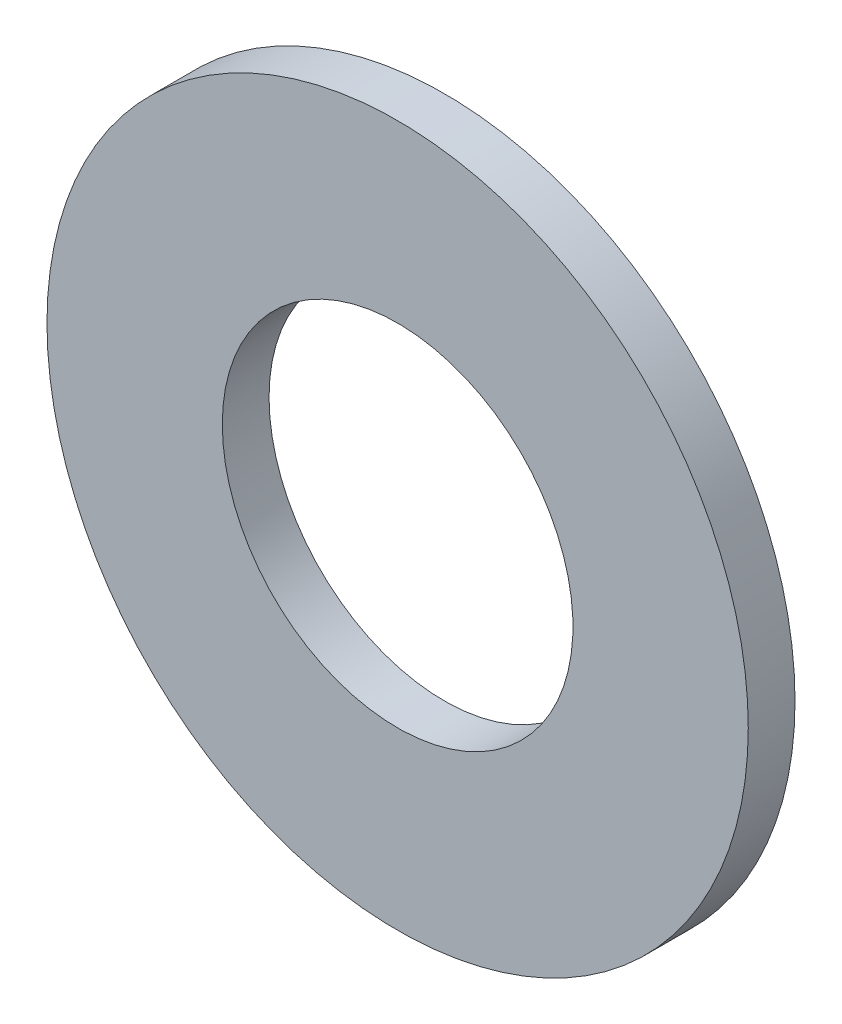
ISO-10303-21;
HEADER;
FILE_DESCRIPTION(('STEP AP214'),'2;1');
FILE_NAME('part.step','',(''),(''),'','','');
FILE_SCHEMA(('AUTOMOTIVE_DESIGN { 1 0 10303 214 1 1 1 1 }'));
ENDSEC;
DATA;
#1=APPLICATION_CONTEXT('core data for automotive mechanical design processes');
#2=APPLICATION_PROTOCOL_DEFINITION('international standard','automotive_design',2000,#1);
#3=PRODUCT_CONTEXT('',#1,'mechanical');
#4=PRODUCT('Part','Part','',(#3));
#5=PRODUCT_RELATED_PRODUCT_CATEGORY('part','',(#4));
#6=PRODUCT_DEFINITION_FORMATION('','',#4);
#7=PRODUCT_DEFINITION_CONTEXT('part definition',#1,'design');
#8=PRODUCT_DEFINITION('design','',#6,#7);
#9=PRODUCT_DEFINITION_SHAPE('','',#8);
#10=(LENGTH_UNIT() NAMED_UNIT(*) SI_UNIT(.MILLI.,.METRE.));
#11=(NAMED_UNIT(*) PLANE_ANGLE_UNIT() SI_UNIT($,.RADIAN.));
#12=(NAMED_UNIT(*) SI_UNIT($,.STERADIAN.) SOLID_ANGLE_UNIT());
#13=UNCERTAINTY_MEASURE_WITH_UNIT(LENGTH_MEASURE(1.E-05),#10,'distance_accuracy_value','');
#14=(GEOMETRIC_REPRESENTATION_CONTEXT(3) GLOBAL_UNCERTAINTY_ASSIGNED_CONTEXT((#13)) GLOBAL_UNIT_ASSIGNED_CONTEXT((#10,
#11,#12)) REPRESENTATION_CONTEXT('',''));
#15=CARTESIAN_POINT('',(0.,0.,0.));
#16=DIRECTION('',(0.,0.,1.));
#17=DIRECTION('',(1.,0.,0.));
#18=AXIS2_PLACEMENT_3D('',#15,#16,#17);
#19=CARTESIAN_POINT('',(0.,0.,0.2));
#20=DIRECTION('',(0.,0.,-1.));
#21=DIRECTION('',(-1.,0.,0.));
#22=AXIS2_PLACEMENT_3D('',#19,#20,#21);
#23=CYLINDRICAL_SURFACE('',#22,1.5);
#24=CARTESIAN_POINT('',(0.,0.,0.2));
#25=DIRECTION('',(0.,0.,-1.));
#26=DIRECTION('',(-1.,0.,0.));
#27=AXIS2_PLACEMENT_3D('',#24,#25,#26);
#28=CIRCLE('',#27,1.5);
#29=CARTESIAN_POINT('',(-1.5,0.,0.2));
#30=VERTEX_POINT('',#29);
#31=EDGE_CURVE('E19',#30,#30,#28,.F.);
#32=ORIENTED_EDGE('',*,*,#31,.F.);
#33=EDGE_LOOP('',(#32));
#34=FACE_BOUND('',#33,.T.);
#35=CARTESIAN_POINT('',(0.,0.,0.));
#36=DIRECTION('',(0.,0.,-1.));
#37=DIRECTION('',(-1.,0.,0.));
#38=AXIS2_PLACEMENT_3D('',#35,#36,#37);
#39=CIRCLE('',#38,1.5);
#40=CARTESIAN_POINT('',(-1.5,0.,0.));
#41=VERTEX_POINT('',#40);
#42=EDGE_CURVE('E28',#41,#41,#39,.F.);
#43=ORIENTED_EDGE('',*,*,#42,.T.);
#44=EDGE_LOOP('',(#43));
#45=FACE_BOUND('',#44,.T.);
#46=ADVANCED_FACE('F15',(#34,#45),#23,.T.);
#47=CARTESIAN_POINT('',(-1.518,-1.518,0.2));
#48=DIRECTION('',(0.,0.,1.));
#49=DIRECTION('',(1.,0.,0.));
#50=AXIS2_PLACEMENT_3D('',#47,#48,#49);
#51=PLANE('',#50);
#52=CARTESIAN_POINT('',(0.,0.,0.2));
#53=DIRECTION('',(0.,0.,-1.));
#54=DIRECTION('',(-1.,0.,0.));
#55=AXIS2_PLACEMENT_3D('',#52,#53,#54);
#56=CIRCLE('',#55,0.75);
#57=CARTESIAN_POINT('',(-0.75,0.,0.2));
#58=VERTEX_POINT('',#57);
#59=EDGE_CURVE('E23',#58,#58,#56,.F.);
#60=ORIENTED_EDGE('',*,*,#59,.F.);
#61=EDGE_LOOP('',(#60));
#62=FACE_BOUND('',#61,.T.);
#63=ORIENTED_EDGE('',*,*,#31,.T.);
#64=EDGE_LOOP('',(#63));
#65=FACE_BOUND('',#64,.T.);
#66=ADVANCED_FACE('F36',(#62,#65),#51,.T.);
#67=CARTESIAN_POINT('',(-1.518,-1.518,0.));
#68=DIRECTION('',(0.,0.,1.));
#69=DIRECTION('',(1.,0.,0.));
#70=AXIS2_PLACEMENT_3D('',#67,#68,#69);
#71=PLANE('',#70);
#72=CARTESIAN_POINT('',(0.,0.,0.));
#73=DIRECTION('',(0.,0.,-1.));
#74=DIRECTION('',(-1.,0.,0.));
#75=AXIS2_PLACEMENT_3D('',#72,#73,#74);
#76=CIRCLE('',#75,0.75);
#77=CARTESIAN_POINT('',(-0.75,0.,0.));
#78=VERTEX_POINT('',#77);
#79=EDGE_CURVE('E10',#78,#78,#76,.T.);
#80=ORIENTED_EDGE('',*,*,#79,.F.);
#81=EDGE_LOOP('',(#80));
#82=FACE_BOUND('',#81,.T.);
#83=ORIENTED_EDGE('',*,*,#42,.F.);
#84=EDGE_LOOP('',(#83));
#85=FACE_BOUND('',#84,.T.);
#86=ADVANCED_FACE('F17',(#82,#85),#71,.F.);
#87=CARTESIAN_POINT('',(0.,0.,0.2));
#88=DIRECTION('',(0.,0.,-1.));
#89=DIRECTION('',(-1.,0.,0.));
#90=AXIS2_PLACEMENT_3D('',#87,#88,#89);
#91=CYLINDRICAL_SURFACE('',#90,0.75);
#92=ORIENTED_EDGE('',*,*,#59,.T.);
#93=EDGE_LOOP('',(#92));
#94=FACE_BOUND('',#93,.T.);
#95=ORIENTED_EDGE('',*,*,#79,.T.);
#96=EDGE_LOOP('',(#95));
#97=FACE_BOUND('',#96,.T.);
#98=ADVANCED_FACE('F47',(#94,#97),#91,.F.);
#99=CLOSED_SHELL('',(#46,#66,#86,#98));
#100=MANIFOLD_SOLID_BREP('B1',#99);
#101=ADVANCED_BREP_SHAPE_REPRESENTATION('',(#18,#100),#14);
#102=SHAPE_DEFINITION_REPRESENTATION(#9,#101);
ENDSEC;
END-ISO-10303-21;
